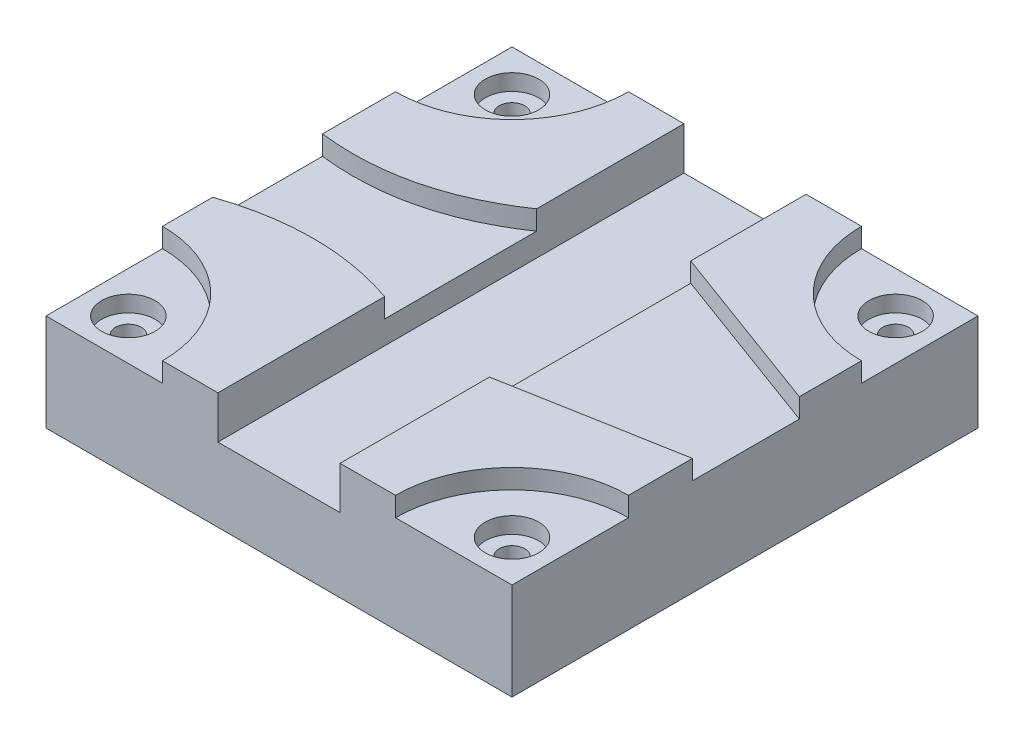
ISO-10303-21;
HEADER;
FILE_DESCRIPTION(('STEP AP214'),'2;1');
FILE_NAME('part.step','',(''),(''),'','','');
FILE_SCHEMA(('AUTOMOTIVE_DESIGN { 1 0 10303 214 1 1 1 1 }'));
ENDSEC;
DATA;
#1=APPLICATION_CONTEXT('core data for automotive mechanical design processes');
#2=APPLICATION_PROTOCOL_DEFINITION('international standard','automotive_design',2000,#1);
#3=PRODUCT_CONTEXT('',#1,'mechanical');
#4=PRODUCT('Part','Part','',(#3));
#5=PRODUCT_RELATED_PRODUCT_CATEGORY('part','',(#4));
#6=PRODUCT_DEFINITION_FORMATION('','',#4);
#7=PRODUCT_DEFINITION_CONTEXT('part definition',#1,'design');
#8=PRODUCT_DEFINITION('design','',#6,#7);
#9=PRODUCT_DEFINITION_SHAPE('','',#8);
#10=(LENGTH_UNIT() NAMED_UNIT(*) SI_UNIT(.MILLI.,.METRE.));
#11=(NAMED_UNIT(*) PLANE_ANGLE_UNIT() SI_UNIT($,.RADIAN.));
#12=(NAMED_UNIT(*) SI_UNIT($,.STERADIAN.) SOLID_ANGLE_UNIT());
#13=UNCERTAINTY_MEASURE_WITH_UNIT(LENGTH_MEASURE(1.E-05),#10,'distance_accuracy_value','');
#14=(GEOMETRIC_REPRESENTATION_CONTEXT(3) GLOBAL_UNCERTAINTY_ASSIGNED_CONTEXT((#13)) GLOBAL_UNIT_ASSIGNED_CONTEXT((#10,
#11,#12)) REPRESENTATION_CONTEXT('',''));
#15=CARTESIAN_POINT('',(0.,0.,0.));
#16=DIRECTION('',(0.,0.,1.));
#17=DIRECTION('',(1.,0.,0.));
#18=AXIS2_PLACEMENT_3D('',#15,#16,#17);
#19=CARTESIAN_POINT('',(-48.1112340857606,0.,16.8721218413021));
#20=DIRECTION('',(0.,1.,0.));
#21=DIRECTION('',(0.,0.,1.));
#22=AXIS2_PLACEMENT_3D('',#19,#20,#21);
#23=PLANE('',#22);
#24=CARTESIAN_POINT('',(76.2,0.,76.2));
#25=DIRECTION('',(0.,1.,0.));
#26=DIRECTION('',(0.,0.,1.));
#27=AXIS2_PLACEMENT_3D('',#24,#25,#26);
#28=CIRCLE('',#27,38.1);
#29=CARTESIAN_POINT('',(76.2,0.,38.1));
#30=VERTEX_POINT('',#29);
#31=CARTESIAN_POINT('',(38.1,0.,76.2));
#32=VERTEX_POINT('',#31);
#33=EDGE_CURVE('E459',#30,#32,#28,.T.);
#34=ORIENTED_EDGE('',*,*,#33,.F.);
#35=DIRECTION('',(0.,0.,1.));
#36=VECTOR('',#35,1.);
#37=CARTESIAN_POINT('',(76.2,0.,76.2));
#38=LINE('',#37,#36);
#39=CARTESIAN_POINT('',(76.2,0.,17.1784901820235));
#40=VERTEX_POINT('',#39);
#41=EDGE_CURVE('E267',#40,#30,#38,.T.);
#42=ORIENTED_EDGE('',*,*,#41,.F.);
#43=DIRECTION('',(0.984064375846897,0.,-0.177812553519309));
#44=VECTOR('',#43,1.);
#45=CARTESIAN_POINT('',(19.9773306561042,0.,27.3374763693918));
#46=LINE('',#45,#44);
#47=CARTESIAN_POINT('',(19.9773306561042,0.,27.3374763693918));
#48=VERTEX_POINT('',#47);
#49=EDGE_CURVE('E228',#40,#48,#46,.F.);
#50=ORIENTED_EDGE('',*,*,#49,.T.);
#51=DIRECTION('',(0.,0.,-1.));
#52=VECTOR('',#51,1.);
#53=CARTESIAN_POINT('',(19.9773306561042,0.,76.2));
#54=LINE('',#53,#52);
#55=CARTESIAN_POINT('',(19.9773306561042,0.,76.2));
#56=VERTEX_POINT('',#55);
#57=EDGE_CURVE('E241',#56,#48,#54,.T.);
#58=ORIENTED_EDGE('',*,*,#57,.F.);
#59=DIRECTION('',(1.,0.,0.));
#60=VECTOR('',#59,1.);
#61=CARTESIAN_POINT('',(-19.9773306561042,0.,76.2));
#62=LINE('',#61,#60);
#63=EDGE_CURVE('E337',#56,#32,#62,.T.);
#64=ORIENTED_EDGE('',*,*,#63,.T.);
#65=EDGE_LOOP('',(#34,#42,#50,#58,#64));
#66=FACE_BOUND('',#65,.T.);
#67=ADVANCED_FACE('F34',(#66),#23,.T.);
#68=CARTESIAN_POINT('',(0.,-6.35,0.));
#69=DIRECTION('',(0.,-1.,0.));
#70=DIRECTION('',(0.,0.,-1.));
#71=AXIS2_PLACEMENT_3D('',#68,#69,#70);
#72=PLANE('',#71);
#73=CARTESIAN_POINT('',(-76.200000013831,-6.35,-14.2260239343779));
#74=CARTESIAN_POINT('',(-45.5451364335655,-6.35,-10.4992931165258));
#75=CARTESIAN_POINT('',(-19.9773306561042,-6.35,-28.0253360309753));
#76=B_SPLINE_CURVE_WITH_KNOTS('',2,(#73,#74,#75),.UNSPECIFIED.,.F.,.F.,(3,3),(0.25164311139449,
0.869678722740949),.UNSPECIFIED.);
#77=CARTESIAN_POINT('',(-76.200000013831,-6.35,-14.2260239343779));
#78=VERTEX_POINT('',#77);
#79=CARTESIAN_POINT('',(-19.9773306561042,-6.35,-28.0253360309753));
#80=VERTEX_POINT('',#79);
#81=EDGE_CURVE('E224',#78,#80,#76,.T.);
#82=ORIENTED_EDGE('',*,*,#81,.F.);
#83=DIRECTION('',(0.,0.,-1.));
#84=VECTOR('',#83,1.);
#85=CARTESIAN_POINT('',(-76.2,-6.35,76.2));
#86=LINE('',#85,#84);
#87=CARTESIAN_POINT('',(-76.2000000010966,-6.35,21.6759097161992));
#88=VERTEX_POINT('',#87);
#89=EDGE_CURVE('E307',#88,#78,#86,.T.);
#90=ORIENTED_EDGE('',*,*,#89,.F.);
#91=CARTESIAN_POINT('',(-19.9773306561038,-6.35,21.6944798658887));
#92=CARTESIAN_POINT('',(-48.1338028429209,-6.35,12.0590488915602));
#93=CARTESIAN_POINT('',(-76.2000000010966,-6.35,21.6759097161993));
#94=B_SPLINE_CURVE_WITH_KNOTS('',2,(#91,#92,#93),.UNSPECIFIED.,.F.,.F.,(3,3),(0.129133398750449,
0.772050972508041),.UNSPECIFIED.);
#95=CARTESIAN_POINT('',(-19.9773306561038,-6.35,21.6944798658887));
#96=VERTEX_POINT('',#95);
#97=EDGE_CURVE('E282',#96,#88,#94,.T.);
#98=ORIENTED_EDGE('',*,*,#97,.F.);
#99=DIRECTION('',(0.,0.,1.));
#100=VECTOR('',#99,1.);
#101=CARTESIAN_POINT('',(-19.9773306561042,-6.35,16.8721218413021));
#102=LINE('',#101,#100);
#103=EDGE_CURVE('E303',#80,#96,#102,.T.);
#104=ORIENTED_EDGE('',*,*,#103,.F.);
#105=EDGE_LOOP('',(#82,#90,#98,#104));
#106=FACE_BOUND('',#105,.T.);
#107=ADVANCED_FACE('F422',(#106),#72,.F.);
#108=CARTESIAN_POINT('',(-19.9773306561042,-6.35,76.2));
#109=DIRECTION('',(0.,0.,1.));
#110=DIRECTION('',(1.,0.,0.));
#111=AXIS2_PLACEMENT_3D('',#108,#109,#110);
#112=PLANE('',#111);
#113=DIRECTION('',(1.,0.,0.));
#114=VECTOR('',#113,1.);
#115=CARTESIAN_POINT('',(-19.9773306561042,-6.34999999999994,76.2));
#116=LINE('',#115,#114);
#117=CARTESIAN_POINT('',(38.1,-6.35000000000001,76.2));
#118=VERTEX_POINT('',#117);
#119=CARTESIAN_POINT('',(76.2,-6.34999999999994,76.2));
#120=VERTEX_POINT('',#119);
#121=EDGE_CURVE('E472',#118,#120,#116,.T.);
#122=ORIENTED_EDGE('',*,*,#121,.F.);
#123=DIRECTION('',(0.,1.,0.));
#124=VECTOR('',#123,1.);
#125=CARTESIAN_POINT('',(38.1,0.,76.2));
#126=LINE('',#125,#124);
#127=EDGE_CURVE('E466',#32,#118,#126,.F.);
#128=ORIENTED_EDGE('',*,*,#127,.F.);
#129=ORIENTED_EDGE('',*,*,#63,.F.);
#130=DIRECTION('',(0.,1.,0.));
#131=VECTOR('',#130,1.);
#132=CARTESIAN_POINT('',(19.9773306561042,-13.97,76.2));
#133=LINE('',#132,#131);
#134=CARTESIAN_POINT('',(19.9773306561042,-13.97,76.2));
#135=VERTEX_POINT('',#134);
#136=EDGE_CURVE('E237',#135,#56,#133,.T.);
#137=ORIENTED_EDGE('',*,*,#136,.F.);
#138=DIRECTION('',(-1.,0.,0.));
#139=VECTOR('',#138,1.);
#140=CARTESIAN_POINT('',(19.9773306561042,-13.97,76.2));
#141=LINE('',#140,#139);
#142=CARTESIAN_POINT('',(-19.9773306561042,-13.97,76.2));
#143=VERTEX_POINT('',#142);
#144=EDGE_CURVE('E450',#135,#143,#141,.T.);
#145=ORIENTED_EDGE('',*,*,#144,.T.);
#146=DIRECTION('',(0.,1.,0.));
#147=VECTOR('',#146,1.);
#148=CARTESIAN_POINT('',(-19.9773306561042,-13.97,76.2));
#149=LINE('',#148,#147);
#150=CARTESIAN_POINT('',(-19.9773306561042,0.,76.2));
#151=VERTEX_POINT('',#150);
#152=EDGE_CURVE('E236',#143,#151,#149,.T.);
#153=ORIENTED_EDGE('',*,*,#152,.T.);
#154=CARTESIAN_POINT('',(-38.1,0.,76.2));
#155=VERTEX_POINT('',#154);
#156=EDGE_CURVE('E328',#155,#151,#62,.T.);
#157=ORIENTED_EDGE('',*,*,#156,.F.);
#158=DIRECTION('',(0.,1.,0.));
#159=VECTOR('',#158,1.);
#160=CARTESIAN_POINT('',(-38.1,0.,76.2));
#161=LINE('',#160,#159);
#162=CARTESIAN_POINT('',(-38.1,-6.35000000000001,76.2));
#163=VERTEX_POINT('',#162);
#164=EDGE_CURVE('E363',#163,#155,#161,.T.);
#165=ORIENTED_EDGE('',*,*,#164,.F.);
#166=DIRECTION('',(1.,0.,0.));
#167=VECTOR('',#166,1.);
#168=CARTESIAN_POINT('',(-19.9773306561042,-6.34999999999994,76.2));
#169=LINE('',#168,#167);
#170=CARTESIAN_POINT('',(-76.2,-6.34999999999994,76.2));
#171=VERTEX_POINT('',#170);
#172=EDGE_CURVE('E366',#171,#163,#169,.T.);
#173=ORIENTED_EDGE('',*,*,#172,.F.);
#174=DIRECTION('',(0.,-1.,0.));
#175=VECTOR('',#174,1.);
#176=CARTESIAN_POINT('',(-76.2,-6.35,76.2));
#177=LINE('',#176,#175);
#178=CARTESIAN_POINT('',(-76.2,-38.1,76.2));
#179=VERTEX_POINT('',#178);
#180=EDGE_CURVE('E306',#171,#179,#177,.T.);
#181=ORIENTED_EDGE('',*,*,#180,.T.);
#182=DIRECTION('',(-1.,0.,0.));
#183=VECTOR('',#182,1.);
#184=CARTESIAN_POINT('',(-19.9773306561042,-38.1,76.2));
#185=LINE('',#184,#183);
#186=CARTESIAN_POINT('',(76.2,-38.1,76.2));
#187=VERTEX_POINT('',#186);
#188=EDGE_CURVE('E317',#187,#179,#185,.T.);
#189=ORIENTED_EDGE('',*,*,#188,.F.);
#190=DIRECTION('',(0.,-1.,0.));
#191=VECTOR('',#190,1.);
#192=CARTESIAN_POINT('',(76.2,-38.1,76.2));
#193=LINE('',#192,#191);
#194=EDGE_CURVE('E266',#120,#187,#193,.T.);
#195=ORIENTED_EDGE('',*,*,#194,.F.);
#196=EDGE_LOOP('',(#122,#128,#129,#137,#145,#153,#157,#165,#173,#181,#189,#195));
#197=FACE_BOUND('',#196,.T.);
#198=ADVANCED_FACE('F424',(#197),#112,.T.);
#199=CARTESIAN_POINT('',(76.2,0.,-76.2));
#200=DIRECTION('',(0.,1.,0.));
#201=DIRECTION('',(0.,0.,1.));
#202=AXIS2_PLACEMENT_3D('',#199,#200,#201);
#203=CIRCLE('',#202,38.1);
#204=CARTESIAN_POINT('',(38.1,0.,-76.2));
#205=VERTEX_POINT('',#204);
#206=CARTESIAN_POINT('',(76.2,0.,-38.1));
#207=VERTEX_POINT('',#206);
#208=EDGE_CURVE('E57',#205,#207,#203,.T.);
#209=ORIENTED_EDGE('',*,*,#208,.F.);
#210=DIRECTION('',(-1.,0.,0.));
#211=VECTOR('',#210,1.);
#212=CARTESIAN_POINT('',(76.2,0.,-76.2));
#213=LINE('',#212,#211);
#214=CARTESIAN_POINT('',(19.9773306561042,0.,-76.2));
#215=VERTEX_POINT('',#214);
#216=EDGE_CURVE('E275',#205,#215,#213,.T.);
#217=ORIENTED_EDGE('',*,*,#216,.T.);
#218=CARTESIAN_POINT('',(19.9773306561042,0.,-38.4697678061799));
#219=VERTEX_POINT('',#218);
#220=EDGE_CURVE('E239',#219,#215,#54,.T.);
#221=ORIENTED_EDGE('',*,*,#220,.F.);
#222=DIRECTION('',(0.93848184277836,0.,0.345328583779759));
#223=VECTOR('',#222,1.);
#224=CARTESIAN_POINT('',(-22.0560936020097,0.,-53.9366018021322));
#225=LINE('',#224,#223);
#226=CARTESIAN_POINT('',(76.2,0.,-17.7817865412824));
#227=VERTEX_POINT('',#226);
#228=EDGE_CURVE('E506',#227,#219,#225,.F.);
#229=ORIENTED_EDGE('',*,*,#228,.F.);
#230=EDGE_CURVE('E264',#207,#227,#38,.T.);
#231=ORIENTED_EDGE('',*,*,#230,.F.);
#232=EDGE_LOOP('',(#209,#217,#221,#229,#231));
#233=FACE_BOUND('',#232,.T.);
#234=ADVANCED_FACE('F414',(#233),#23,.T.);
#235=CARTESIAN_POINT('',(0.,0.,-76.2));
#236=DIRECTION('',(0.,0.,1.));
#237=DIRECTION('',(1.,0.,0.));
#238=AXIS2_PLACEMENT_3D('',#235,#236,#237);
#239=PLANE('',#238);
#240=DIRECTION('',(0.,1.,0.));
#241=VECTOR('',#240,1.);
#242=CARTESIAN_POINT('',(-76.2,-6.35,-76.2));
#243=LINE('',#242,#241);
#244=CARTESIAN_POINT('',(-76.2,-38.1,-76.2));
#245=VERTEX_POINT('',#244);
#246=CARTESIAN_POINT('',(-76.2,-6.34999999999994,-76.2));
#247=VERTEX_POINT('',#246);
#248=EDGE_CURVE('E280',#245,#247,#243,.T.);
#249=ORIENTED_EDGE('',*,*,#248,.T.);
#250=DIRECTION('',(1.,0.,0.));
#251=VECTOR('',#250,1.);
#252=CARTESIAN_POINT('',(0.,-6.34999999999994,-76.2));
#253=LINE('',#252,#251);
#254=CARTESIAN_POINT('',(-38.1,-6.35000000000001,-76.2));
#255=VERTEX_POINT('',#254);
#256=EDGE_CURVE('E42',#247,#255,#253,.T.);
#257=ORIENTED_EDGE('',*,*,#256,.T.);
#258=DIRECTION('',(0.,1.,0.));
#259=VECTOR('',#258,1.);
#260=CARTESIAN_POINT('',(-38.1,0.,-76.2));
#261=LINE('',#260,#259);
#262=CARTESIAN_POINT('',(-38.1,0.,-76.2));
#263=VERTEX_POINT('',#262);
#264=EDGE_CURVE('E195',#255,#263,#261,.T.);
#265=ORIENTED_EDGE('',*,*,#264,.T.);
#266=DIRECTION('',(-1.,0.,0.));
#267=VECTOR('',#266,1.);
#268=CARTESIAN_POINT('',(-76.200000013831,0.,-76.2));
#269=LINE('',#268,#267);
#270=CARTESIAN_POINT('',(-19.9773306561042,0.,-76.2));
#271=VERTEX_POINT('',#270);
#272=EDGE_CURVE('E209',#271,#263,#269,.T.);
#273=ORIENTED_EDGE('',*,*,#272,.F.);
#274=DIRECTION('',(0.,-1.,0.));
#275=VECTOR('',#274,1.);
#276=CARTESIAN_POINT('',(-19.9773306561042,0.,-76.2));
#277=LINE('',#276,#275);
#278=CARTESIAN_POINT('',(-19.9773306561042,-13.97,-76.2));
#279=VERTEX_POINT('',#278);
#280=EDGE_CURVE('E261',#271,#279,#277,.T.);
#281=ORIENTED_EDGE('',*,*,#280,.T.);
#282=DIRECTION('',(-1.,0.,0.));
#283=VECTOR('',#282,1.);
#284=CARTESIAN_POINT('',(19.9773306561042,-13.97,-76.2));
#285=LINE('',#284,#283);
#286=CARTESIAN_POINT('',(19.9773306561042,-13.97,-76.2));
#287=VERTEX_POINT('',#286);
#288=EDGE_CURVE('E249',#287,#279,#285,.T.);
#289=ORIENTED_EDGE('',*,*,#288,.F.);
#290=DIRECTION('',(0.,-1.,0.));
#291=VECTOR('',#290,1.);
#292=CARTESIAN_POINT('',(19.9773306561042,0.,-76.2));
#293=LINE('',#292,#291);
#294=EDGE_CURVE('E244',#215,#287,#293,.T.);
#295=ORIENTED_EDGE('',*,*,#294,.F.);
#296=ORIENTED_EDGE('',*,*,#216,.F.);
#297=DIRECTION('',(0.,1.,0.));
#298=VECTOR('',#297,1.);
#299=CARTESIAN_POINT('',(38.1,0.,-76.2));
#300=LINE('',#299,#298);
#301=CARTESIAN_POINT('',(38.1,-6.35000000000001,-76.2));
#302=VERTEX_POINT('',#301);
#303=EDGE_CURVE('E441',#205,#302,#300,.F.);
#304=ORIENTED_EDGE('',*,*,#303,.T.);
#305=DIRECTION('',(1.,0.,0.));
#306=VECTOR('',#305,1.);
#307=CARTESIAN_POINT('',(0.,-6.34999999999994,-76.2));
#308=LINE('',#307,#306);
#309=CARTESIAN_POINT('',(76.2,-6.34999999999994,-76.2));
#310=VERTEX_POINT('',#309);
#311=EDGE_CURVE('E463',#302,#310,#308,.T.);
#312=ORIENTED_EDGE('',*,*,#311,.T.);
#313=DIRECTION('',(0.,1.,0.));
#314=VECTOR('',#313,1.);
#315=CARTESIAN_POINT('',(76.2,0.,-76.2));
#316=LINE('',#315,#314);
#317=CARTESIAN_POINT('',(76.2,-38.1,-76.2));
#318=VERTEX_POINT('',#317);
#319=EDGE_CURVE('E272',#318,#310,#316,.T.);
#320=ORIENTED_EDGE('',*,*,#319,.F.);
#321=DIRECTION('',(-1.,0.,0.));
#322=VECTOR('',#321,1.);
#323=CARTESIAN_POINT('',(-76.2,-38.1,-76.2));
#324=LINE('',#323,#322);
#325=EDGE_CURVE('E277',#318,#245,#324,.T.);
#326=ORIENTED_EDGE('',*,*,#325,.T.);
#327=EDGE_LOOP('',(#249,#257,#265,#273,#281,#289,#295,#296,#304,#312,#320,#326));
#328=FACE_BOUND('',#327,.T.);
#329=ADVANCED_FACE('F207',(#328),#239,.F.);
#330=CARTESIAN_POINT('',(-76.2,-6.35,76.2));
#331=DIRECTION('',(-1.,0.,0.));
#332=DIRECTION('',(0.,0.,1.));
#333=AXIS2_PLACEMENT_3D('',#330,#331,#332);
#334=PLANE('',#333);
#335=DIRECTION('',(0.,0.,1.));
#336=VECTOR('',#335,1.);
#337=CARTESIAN_POINT('',(-76.2,-6.34999999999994,76.2));
#338=LINE('',#337,#336);
#339=CARTESIAN_POINT('',(-76.2,-6.35000000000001,-38.1));
#340=VERTEX_POINT('',#339);
#341=EDGE_CURVE('E11',#247,#340,#338,.T.);
#342=ORIENTED_EDGE('',*,*,#341,.F.);
#343=ORIENTED_EDGE('',*,*,#248,.F.);
#344=DIRECTION('',(0.,0.,-1.));
#345=VECTOR('',#344,1.);
#346=CARTESIAN_POINT('',(-76.2,-38.1,76.2));
#347=LINE('',#346,#345);
#348=EDGE_CURVE('E315',#179,#245,#347,.T.);
#349=ORIENTED_EDGE('',*,*,#348,.F.);
#350=ORIENTED_EDGE('',*,*,#180,.F.);
#351=DIRECTION('',(0.,0.,1.));
#352=VECTOR('',#351,1.);
#353=CARTESIAN_POINT('',(-76.2,-6.34999999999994,76.2));
#354=LINE('',#353,#352);
#355=CARTESIAN_POINT('',(-76.2,-6.35000000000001,38.1));
#356=VERTEX_POINT('',#355);
#357=EDGE_CURVE('E322',#356,#171,#354,.T.);
#358=ORIENTED_EDGE('',*,*,#357,.F.);
#359=DIRECTION('',(0.,1.,0.));
#360=VECTOR('',#359,1.);
#361=CARTESIAN_POINT('',(-76.2,0.,38.1));
#362=LINE('',#361,#360);
#363=CARTESIAN_POINT('',(-76.2000000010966,0.,38.1));
#364=VERTEX_POINT('',#363);
#365=EDGE_CURVE('E358',#364,#356,#362,.F.);
#366=ORIENTED_EDGE('',*,*,#365,.F.);
#367=DIRECTION('',(0.,0.,1.));
#368=VECTOR('',#367,1.);
#369=CARTESIAN_POINT('',(-76.2000000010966,0.,76.2));
#370=LINE('',#369,#368);
#371=CARTESIAN_POINT('',(-76.2000000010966,0.,21.6759097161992));
#372=VERTEX_POINT('',#371);
#373=EDGE_CURVE('E287',#372,#364,#370,.T.);
#374=ORIENTED_EDGE('',*,*,#373,.F.);
#375=DIRECTION('',(0.,-1.,0.));
#376=VECTOR('',#375,1.);
#377=CARTESIAN_POINT('',(-76.2000000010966,0.,21.6759097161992));
#378=LINE('',#377,#376);
#379=EDGE_CURVE('E325',#372,#88,#378,.T.);
#380=ORIENTED_EDGE('',*,*,#379,.T.);
#381=ORIENTED_EDGE('',*,*,#89,.T.);
#382=DIRECTION('',(0.,-1.,0.));
#383=VECTOR('',#382,1.);
#384=CARTESIAN_POINT('',(-76.200000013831,0.,-14.2260239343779));
#385=LINE('',#384,#383);
#386=CARTESIAN_POINT('',(-76.200000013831,0.,-14.2260239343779));
#387=VERTEX_POINT('',#386);
#388=EDGE_CURVE('E218',#387,#78,#385,.T.);
#389=ORIENTED_EDGE('',*,*,#388,.F.);
#390=DIRECTION('',(0.,0.,1.));
#391=VECTOR('',#390,1.);
#392=CARTESIAN_POINT('',(-76.200000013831,0.,-14.2260239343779));
#393=LINE('',#392,#391);
#394=CARTESIAN_POINT('',(-76.200000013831,0.,-38.1));
#395=VERTEX_POINT('',#394);
#396=EDGE_CURVE('E216',#395,#387,#393,.T.);
#397=ORIENTED_EDGE('',*,*,#396,.F.);
#398=DIRECTION('',(0.,1.,0.));
#399=VECTOR('',#398,1.);
#400=CARTESIAN_POINT('',(-76.2,0.,-38.1));
#401=LINE('',#400,#399);
#402=EDGE_CURVE('E49',#340,#395,#401,.T.);
#403=ORIENTED_EDGE('',*,*,#402,.F.);
#404=EDGE_LOOP('',(#342,#343,#349,#350,#358,#366,#374,#380,#381,#389,#397,#403));
#405=FACE_BOUND('',#404,.T.);
#406=ADVANCED_FACE('F356',(#405),#334,.T.);
#407=CARTESIAN_POINT('',(0.,-38.1,0.));
#408=DIRECTION('',(0.,-1.,0.));
#409=DIRECTION('',(0.,0.,-1.));
#410=AXIS2_PLACEMENT_3D('',#407,#408,#409);
#411=PLANE('',#410);
#412=CARTESIAN_POINT('',(-62.7296158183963,-38.1,-62.7296158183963));
#413=DIRECTION('',(0.,1.,0.));
#414=DIRECTION('',(0.,0.,1.));
#415=AXIS2_PLACEMENT_3D('',#412,#413,#414);
#416=CIRCLE('',#415,4.2164);
#417=CARTESIAN_POINT('',(-62.7296158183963,-38.1,-58.5132158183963));
#418=VERTEX_POINT('',#417);
#419=EDGE_CURVE('E833',#418,#418,#416,.T.);
#420=ORIENTED_EDGE('',*,*,#419,.T.);
#421=EDGE_LOOP('',(#420));
#422=FACE_BOUND('',#421,.T.);
#423=CARTESIAN_POINT('',(62.7296158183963,-38.1,-62.7296158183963));
#424=DIRECTION('',(0.,1.,0.));
#425=DIRECTION('',(0.,0.,1.));
#426=AXIS2_PLACEMENT_3D('',#423,#424,#425);
#427=CIRCLE('',#426,4.21640000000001);
#428=CARTESIAN_POINT('',(62.7296158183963,-38.1,-58.5132158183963));
#429=VERTEX_POINT('',#428);
#430=EDGE_CURVE('E844',#429,#429,#427,.T.);
#431=ORIENTED_EDGE('',*,*,#430,.T.);
#432=EDGE_LOOP('',(#431));
#433=FACE_BOUND('',#432,.T.);
#434=CARTESIAN_POINT('',(62.7296158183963,-38.1,62.7296158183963));
#435=DIRECTION('',(0.,1.,0.));
#436=DIRECTION('',(0.,0.,1.));
#437=AXIS2_PLACEMENT_3D('',#434,#435,#436);
#438=CIRCLE('',#437,4.21640000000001);
#439=CARTESIAN_POINT('',(62.7296158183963,-38.1,66.9460158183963));
#440=VERTEX_POINT('',#439);
#441=EDGE_CURVE('E856',#440,#440,#438,.T.);
#442=ORIENTED_EDGE('',*,*,#441,.T.);
#443=EDGE_LOOP('',(#442));
#444=FACE_BOUND('',#443,.T.);
#445=CARTESIAN_POINT('',(-62.7296158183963,-38.1,62.7296158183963));
#446=DIRECTION('',(0.,1.,0.));
#447=DIRECTION('',(0.,0.,1.));
#448=AXIS2_PLACEMENT_3D('',#445,#446,#447);
#449=CIRCLE('',#448,4.2164);
#450=CARTESIAN_POINT('',(-62.7296158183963,-38.1,66.9460158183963));
#451=VERTEX_POINT('',#450);
#452=EDGE_CURVE('E201',#451,#451,#449,.T.);
#453=ORIENTED_EDGE('',*,*,#452,.T.);
#454=EDGE_LOOP('',(#453));
#455=FACE_BOUND('',#454,.T.);
#456=ORIENTED_EDGE('',*,*,#348,.T.);
#457=ORIENTED_EDGE('',*,*,#325,.F.);
#458=DIRECTION('',(0.,0.,-1.));
#459=VECTOR('',#458,1.);
#460=CARTESIAN_POINT('',(76.2,-38.1,-76.2));
#461=LINE('',#460,#459);
#462=EDGE_CURVE('E269',#187,#318,#461,.T.);
#463=ORIENTED_EDGE('',*,*,#462,.F.);
#464=ORIENTED_EDGE('',*,*,#188,.T.);
#465=EDGE_LOOP('',(#456,#457,#463,#464));
#466=FACE_BOUND('',#465,.T.);
#467=ADVANCED_FACE('F419',(#422,#433,#444,#455,#466),#411,.T.);
#468=CARTESIAN_POINT('',(-19.9773306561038,0.,21.6944798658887));
#469=CARTESIAN_POINT('',(-48.1338028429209,0.,12.0590488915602));
#470=CARTESIAN_POINT('',(-76.2000000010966,0.,21.6759097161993));
#471=B_SPLINE_CURVE_WITH_KNOTS('',2,(#468,#469,#470),.UNSPECIFIED.,.F.,.F.,(3,3),
(0.129133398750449,0.772050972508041),.UNSPECIFIED.);
#472=DIRECTION('',(0.,-1.,0.));
#473=VECTOR('',#472,1.);
#474=SURFACE_OF_LINEAR_EXTRUSION('',#471,#473);
#475=ORIENTED_EDGE('',*,*,#97,.T.);
#476=ORIENTED_EDGE('',*,*,#379,.F.);
#477=CARTESIAN_POINT('',(-19.9773306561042,0.,21.6944798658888));
#478=VERTEX_POINT('',#477);
#479=EDGE_CURVE('E298',#478,#372,#471,.T.);
#480=ORIENTED_EDGE('',*,*,#479,.F.);
#481=DIRECTION('',(0.,-1.,0.));
#482=VECTOR('',#481,1.);
#483=CARTESIAN_POINT('',(-19.9773306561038,0.,21.6944798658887));
#484=LINE('',#483,#482);
#485=EDGE_CURVE('E318',#478,#96,#484,.T.);
#486=ORIENTED_EDGE('',*,*,#485,.T.);
#487=EDGE_LOOP('',(#475,#476,#480,#486));
#488=FACE_BOUND('',#487,.T.);
#489=ADVANCED_FACE('F294',(#488),#474,.F.);
#490=CARTESIAN_POINT('',(-76.2,0.,76.2));
#491=DIRECTION('',(0.,1.,0.));
#492=DIRECTION('',(0.,0.,1.));
#493=AXIS2_PLACEMENT_3D('',#490,#491,#492);
#494=CIRCLE('',#493,38.1);
#495=EDGE_CURVE('E350',#155,#364,#494,.T.);
#496=ORIENTED_EDGE('',*,*,#495,.F.);
#497=ORIENTED_EDGE('',*,*,#156,.T.);
#498=DIRECTION('',(0.,0.,-1.));
#499=VECTOR('',#498,1.);
#500=CARTESIAN_POINT('',(-19.9773306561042,0.,76.2));
#501=LINE('',#500,#499);
#502=EDGE_CURVE('E252',#151,#478,#501,.T.);
#503=ORIENTED_EDGE('',*,*,#502,.T.);
#504=ORIENTED_EDGE('',*,*,#479,.T.);
#505=ORIENTED_EDGE('',*,*,#373,.T.);
#506=EDGE_LOOP('',(#496,#497,#503,#504,#505));
#507=FACE_BOUND('',#506,.T.);
#508=ADVANCED_FACE('F349',(#507),#23,.T.);
#509=CARTESIAN_POINT('',(76.2,0.,0.));
#510=DIRECTION('',(-1.,0.,0.));
#511=DIRECTION('',(0.,0.,1.));
#512=AXIS2_PLACEMENT_3D('',#509,#510,#511);
#513=PLANE('',#512);
#514=ORIENTED_EDGE('',*,*,#319,.T.);
#515=DIRECTION('',(0.,0.,1.));
#516=VECTOR('',#515,1.);
#517=CARTESIAN_POINT('',(76.2,-6.34999999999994,0.));
#518=LINE('',#517,#516);
#519=CARTESIAN_POINT('',(76.2,-6.35000000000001,-38.1));
#520=VERTEX_POINT('',#519);
#521=EDGE_CURVE('E210',#310,#520,#518,.T.);
#522=ORIENTED_EDGE('',*,*,#521,.T.);
#523=DIRECTION('',(0.,1.,0.));
#524=VECTOR('',#523,1.);
#525=CARTESIAN_POINT('',(76.2,0.,-38.1));
#526=LINE('',#525,#524);
#527=EDGE_CURVE('E495',#520,#207,#526,.T.);
#528=ORIENTED_EDGE('',*,*,#527,.T.);
#529=ORIENTED_EDGE('',*,*,#230,.T.);
#530=DIRECTION('',(0.,1.,0.));
#531=VECTOR('',#530,1.);
#532=CARTESIAN_POINT('',(76.2,0.,-17.7817865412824));
#533=LINE('',#532,#531);
#534=CARTESIAN_POINT('',(76.2,-6.35,-17.7817865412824));
#535=VERTEX_POINT('',#534);
#536=EDGE_CURVE('E377',#227,#535,#533,.F.);
#537=ORIENTED_EDGE('',*,*,#536,.T.);
#538=DIRECTION('',(0.,0.,1.));
#539=VECTOR('',#538,1.);
#540=CARTESIAN_POINT('',(76.2,-6.35,-38.46976780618));
#541=LINE('',#540,#539);
#542=CARTESIAN_POINT('',(76.2,-6.35,17.1784901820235));
#543=VERTEX_POINT('',#542);
#544=EDGE_CURVE('E373',#535,#543,#541,.T.);
#545=ORIENTED_EDGE('',*,*,#544,.T.);
#546=DIRECTION('',(0.,-1.,0.));
#547=VECTOR('',#546,1.);
#548=CARTESIAN_POINT('',(76.2,0.,17.1784901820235));
#549=LINE('',#548,#547);
#550=EDGE_CURVE('E376',#543,#40,#549,.F.);
#551=ORIENTED_EDGE('',*,*,#550,.T.);
#552=ORIENTED_EDGE('',*,*,#41,.T.);
#553=DIRECTION('',(0.,1.,0.));
#554=VECTOR('',#553,1.);
#555=CARTESIAN_POINT('',(76.2,0.,38.1));
#556=LINE('',#555,#554);
#557=CARTESIAN_POINT('',(76.2,-6.35000000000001,38.1));
#558=VERTEX_POINT('',#557);
#559=EDGE_CURVE('E456',#30,#558,#556,.F.);
#560=ORIENTED_EDGE('',*,*,#559,.T.);
#561=DIRECTION('',(0.,0.,1.));
#562=VECTOR('',#561,1.);
#563=CARTESIAN_POINT('',(76.2,-6.34999999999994,0.));
#564=LINE('',#563,#562);
#565=EDGE_CURVE('E498',#558,#120,#564,.T.);
#566=ORIENTED_EDGE('',*,*,#565,.T.);
#567=ORIENTED_EDGE('',*,*,#194,.T.);
#568=ORIENTED_EDGE('',*,*,#462,.T.);
#569=EDGE_LOOP('',(#514,#522,#528,#529,#537,#545,#551,#552,#560,#566,#567,#568));
#570=FACE_BOUND('',#569,.T.);
#571=ADVANCED_FACE('F405',(#570),#513,.F.);
#572=CARTESIAN_POINT('',(-19.9773306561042,0.,0.));
#573=DIRECTION('',(-1.,0.,0.));
#574=DIRECTION('',(0.,0.,1.));
#575=AXIS2_PLACEMENT_3D('',#572,#573,#574);
#576=PLANE('',#575);
#577=ORIENTED_EDGE('',*,*,#485,.F.);
#578=ORIENTED_EDGE('',*,*,#502,.F.);
#579=ORIENTED_EDGE('',*,*,#152,.F.);
#580=DIRECTION('',(0.,0.,1.));
#581=VECTOR('',#580,1.);
#582=CARTESIAN_POINT('',(-19.9773306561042,-13.97,-76.2));
#583=LINE('',#582,#581);
#584=EDGE_CURVE('E240',#279,#143,#583,.T.);
#585=ORIENTED_EDGE('',*,*,#584,.F.);
#586=ORIENTED_EDGE('',*,*,#280,.F.);
#587=DIRECTION('',(0.,0.,-1.));
#588=VECTOR('',#587,1.);
#589=CARTESIAN_POINT('',(-19.9773306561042,0.,-76.2));
#590=LINE('',#589,#588);
#591=CARTESIAN_POINT('',(-19.9773306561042,0.,-28.0253360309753));
#592=VERTEX_POINT('',#591);
#593=EDGE_CURVE('E215',#592,#271,#590,.T.);
#594=ORIENTED_EDGE('',*,*,#593,.F.);
#595=DIRECTION('',(0.,-1.,0.));
#596=VECTOR('',#595,1.);
#597=CARTESIAN_POINT('',(-19.9773306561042,0.,-28.0253360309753));
#598=LINE('',#597,#596);
#599=EDGE_CURVE('E233',#592,#80,#598,.T.);
#600=ORIENTED_EDGE('',*,*,#599,.T.);
#601=ORIENTED_EDGE('',*,*,#103,.T.);
#602=EDGE_LOOP('',(#577,#578,#579,#585,#586,#594,#600,#601));
#603=FACE_BOUND('',#602,.T.);
#604=ADVANCED_FACE('F402',(#603),#576,.F.);
#605=CARTESIAN_POINT('',(19.9773306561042,-13.97,-76.2));
#606=DIRECTION('',(0.,-1.,0.));
#607=DIRECTION('',(0.,0.,-1.));
#608=AXIS2_PLACEMENT_3D('',#605,#606,#607);
#609=PLANE('',#608);
#610=ORIENTED_EDGE('',*,*,#584,.T.);
#611=ORIENTED_EDGE('',*,*,#144,.F.);
#612=DIRECTION('',(0.,0.,1.));
#613=VECTOR('',#612,1.);
#614=CARTESIAN_POINT('',(19.9773306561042,-13.97,-76.2));
#615=LINE('',#614,#613);
#616=EDGE_CURVE('E246',#287,#135,#615,.T.);
#617=ORIENTED_EDGE('',*,*,#616,.F.);
#618=ORIENTED_EDGE('',*,*,#288,.T.);
#619=EDGE_LOOP('',(#610,#611,#617,#618));
#620=FACE_BOUND('',#619,.T.);
#621=ADVANCED_FACE('F400',(#620),#609,.F.);
#622=CARTESIAN_POINT('',(19.9773306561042,0.,0.));
#623=DIRECTION('',(-1.,0.,0.));
#624=DIRECTION('',(0.,0.,1.));
#625=AXIS2_PLACEMENT_3D('',#622,#623,#624);
#626=PLANE('',#625);
#627=DIRECTION('',(0.,1.,0.));
#628=VECTOR('',#627,1.);
#629=CARTESIAN_POINT('',(19.9773306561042,-6.35,27.3374763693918));
#630=LINE('',#629,#628);
#631=CARTESIAN_POINT('',(19.9773306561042,-6.35,27.3374763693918));
#632=VERTEX_POINT('',#631);
#633=EDGE_CURVE('E383',#632,#48,#630,.T.);
#634=ORIENTED_EDGE('',*,*,#633,.F.);
#635=DIRECTION('',(0.,0.,1.));
#636=VECTOR('',#635,1.);
#637=CARTESIAN_POINT('',(19.9773306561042,-6.35,-38.46976780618));
#638=LINE('',#637,#636);
#639=CARTESIAN_POINT('',(19.9773306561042,-6.35,-38.46976780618));
#640=VERTEX_POINT('',#639);
#641=EDGE_CURVE('E380',#640,#632,#638,.T.);
#642=ORIENTED_EDGE('',*,*,#641,.F.);
#643=DIRECTION('',(0.,-1.,0.));
#644=VECTOR('',#643,1.);
#645=CARTESIAN_POINT('',(19.9773306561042,0.,-38.46976780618));
#646=LINE('',#645,#644);
#647=EDGE_CURVE('E372',#219,#640,#646,.T.);
#648=ORIENTED_EDGE('',*,*,#647,.F.);
#649=ORIENTED_EDGE('',*,*,#220,.T.);
#650=ORIENTED_EDGE('',*,*,#294,.T.);
#651=ORIENTED_EDGE('',*,*,#616,.T.);
#652=ORIENTED_EDGE('',*,*,#136,.T.);
#653=ORIENTED_EDGE('',*,*,#57,.T.);
#654=EDGE_LOOP('',(#634,#642,#648,#649,#650,#651,#652,#653));
#655=FACE_BOUND('',#654,.T.);
#656=ADVANCED_FACE('F395',(#655),#626,.T.);
#657=CARTESIAN_POINT('',(-76.200000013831,0.,-14.2260239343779));
#658=CARTESIAN_POINT('',(-45.5451364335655,0.,-10.4992931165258));
#659=CARTESIAN_POINT('',(-19.9773306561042,0.,-28.0253360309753));
#660=B_SPLINE_CURVE_WITH_KNOTS('',2,(#657,#658,#659),.UNSPECIFIED.,.F.,.F.,(3,3),
(0.25164311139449,0.869678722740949),.UNSPECIFIED.);
#661=DIRECTION('',(0.,-1.,0.));
#662=VECTOR('',#661,1.);
#663=SURFACE_OF_LINEAR_EXTRUSION('',#660,#662);
#664=ORIENTED_EDGE('',*,*,#81,.T.);
#665=ORIENTED_EDGE('',*,*,#599,.F.);
#666=EDGE_CURVE('E220',#387,#592,#660,.T.);
#667=ORIENTED_EDGE('',*,*,#666,.F.);
#668=ORIENTED_EDGE('',*,*,#388,.T.);
#669=EDGE_LOOP('',(#664,#665,#667,#668));
#670=FACE_BOUND('',#669,.T.);
#671=ADVANCED_FACE('F391',(#670),#663,.F.);
#672=CARTESIAN_POINT('',(-46.8169008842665,0.,-15.8124865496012));
#673=DIRECTION('',(0.,1.,0.));
#674=DIRECTION('',(0.,0.,1.));
#675=AXIS2_PLACEMENT_3D('',#672,#673,#674);
#676=PLANE('',#675);
#677=CARTESIAN_POINT('',(-76.2,0.,-76.2));
#678=DIRECTION('',(0.,1.,0.));
#679=DIRECTION('',(0.,0.,1.));
#680=AXIS2_PLACEMENT_3D('',#677,#678,#679);
#681=CIRCLE('',#680,38.1);
#682=EDGE_CURVE('E192',#395,#263,#681,.T.);
#683=ORIENTED_EDGE('',*,*,#682,.F.);
#684=ORIENTED_EDGE('',*,*,#396,.T.);
#685=ORIENTED_EDGE('',*,*,#666,.T.);
#686=ORIENTED_EDGE('',*,*,#593,.T.);
#687=ORIENTED_EDGE('',*,*,#272,.T.);
#688=EDGE_LOOP('',(#683,#684,#685,#686,#687));
#689=FACE_BOUND('',#688,.T.);
#690=ADVANCED_FACE('F213',(#689),#676,.T.);
#691=CARTESIAN_POINT('',(19.9773306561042,-6.35,27.3374763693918));
#692=DIRECTION('',(-0.177812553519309,0.,-0.984064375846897));
#693=DIRECTION('',(-0.984064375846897,0.,0.177812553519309));
#694=AXIS2_PLACEMENT_3D('',#691,#692,#693);
#695=PLANE('',#694);
#696=ORIENTED_EDGE('',*,*,#633,.T.);
#697=ORIENTED_EDGE('',*,*,#49,.F.);
#698=ORIENTED_EDGE('',*,*,#550,.F.);
#699=DIRECTION('',(0.984064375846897,0.,-0.177812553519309));
#700=VECTOR('',#699,1.);
#701=CARTESIAN_POINT('',(85.9372765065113,-6.35,15.4190422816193));
#702=LINE('',#701,#700);
#703=EDGE_CURVE('E308',#543,#632,#702,.F.);
#704=ORIENTED_EDGE('',*,*,#703,.T.);
#705=EDGE_LOOP('',(#696,#697,#698,#704));
#706=FACE_BOUND('',#705,.T.);
#707=ADVANCED_FACE('F511',(#706),#695,.T.);
#708=CARTESIAN_POINT('',(76.2,-6.35,-38.46976780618));
#709=DIRECTION('',(0.,-1.,0.));
#710=DIRECTION('',(0.,0.,-1.));
#711=AXIS2_PLACEMENT_3D('',#708,#709,#710);
#712=PLANE('',#711);
#713=ORIENTED_EDGE('',*,*,#641,.T.);
#714=ORIENTED_EDGE('',*,*,#703,.F.);
#715=ORIENTED_EDGE('',*,*,#544,.F.);
#716=DIRECTION('',(0.93848184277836,0.,0.345328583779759));
#717=VECTOR('',#716,1.);
#718=CARTESIAN_POINT('',(19.9773306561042,-6.35,-38.46976780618));
#719=LINE('',#718,#717);
#720=EDGE_CURVE('E504',#535,#640,#719,.F.);
#721=ORIENTED_EDGE('',*,*,#720,.T.);
#722=EDGE_LOOP('',(#713,#714,#715,#721));
#723=FACE_BOUND('',#722,.T.);
#724=ADVANCED_FACE('F515',(#723),#712,.F.);
#725=CARTESIAN_POINT('',(19.9773306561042,0.,-38.46976780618));
#726=DIRECTION('',(-0.345328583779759,0.,0.93848184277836));
#727=DIRECTION('',(0.93848184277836,0.,0.345328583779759));
#728=AXIS2_PLACEMENT_3D('',#725,#726,#727);
#729=PLANE('',#728);
#730=ORIENTED_EDGE('',*,*,#647,.T.);
#731=ORIENTED_EDGE('',*,*,#720,.F.);
#732=ORIENTED_EDGE('',*,*,#536,.F.);
#733=ORIENTED_EDGE('',*,*,#228,.T.);
#734=EDGE_LOOP('',(#730,#731,#732,#733));
#735=FACE_BOUND('',#734,.T.);
#736=ADVANCED_FACE('F36',(#735),#729,.T.);
#737=CARTESIAN_POINT('',(-76.2,-6.34999999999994,76.2));
#738=DIRECTION('',(0.,-1.,0.));
#739=DIRECTION('',(0.,0.,-1.));
#740=AXIS2_PLACEMENT_3D('',#737,#738,#739);
#741=PLANE('',#740);
#742=CARTESIAN_POINT('',(-62.7296158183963,-6.34999999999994,62.7296158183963));
#743=DIRECTION('',(0.,1.,0.));
#744=DIRECTION('',(0.,0.,1.));
#745=AXIS2_PLACEMENT_3D('',#742,#743,#744);
#746=CIRCLE('',#745,8.73125);
#747=CARTESIAN_POINT('',(-62.7296158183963,-6.34999999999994,71.4608658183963));
#748=VERTEX_POINT('',#747);
#749=EDGE_CURVE('E859',#748,#748,#746,.T.);
#750=ORIENTED_EDGE('',*,*,#749,.F.);
#751=EDGE_LOOP('',(#750));
#752=FACE_BOUND('',#751,.T.);
#753=ORIENTED_EDGE('',*,*,#172,.T.);
#754=CARTESIAN_POINT('',(-76.2,-6.35000000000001,76.2));
#755=DIRECTION('',(0.,1.,0.));
#756=DIRECTION('',(0.,0.,1.));
#757=AXIS2_PLACEMENT_3D('',#754,#755,#756);
#758=CIRCLE('',#757,38.1);
#759=EDGE_CURVE('E364',#163,#356,#758,.T.);
#760=ORIENTED_EDGE('',*,*,#759,.T.);
#761=ORIENTED_EDGE('',*,*,#357,.T.);
#762=EDGE_LOOP('',(#753,#760,#761));
#763=FACE_BOUND('',#762,.T.);
#764=ADVANCED_FACE('F618',(#752,#763),#741,.F.);
#765=CARTESIAN_POINT('',(-76.2,0.,76.2));
#766=DIRECTION('',(0.,1.,0.));
#767=DIRECTION('',(0.,0.,1.));
#768=AXIS2_PLACEMENT_3D('',#765,#766,#767);
#769=CYLINDRICAL_SURFACE('',#768,38.1);
#770=ORIENTED_EDGE('',*,*,#164,.T.);
#771=ORIENTED_EDGE('',*,*,#495,.T.);
#772=ORIENTED_EDGE('',*,*,#365,.T.);
#773=ORIENTED_EDGE('',*,*,#759,.F.);
#774=EDGE_LOOP('',(#770,#771,#772,#773));
#775=FACE_BOUND('',#774,.T.);
#776=ADVANCED_FACE('F473',(#775),#769,.F.);
#777=CARTESIAN_POINT('',(76.2,-6.34999999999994,76.2));
#778=DIRECTION('',(0.,-1.,0.));
#779=DIRECTION('',(0.,0.,-1.));
#780=AXIS2_PLACEMENT_3D('',#777,#778,#779);
#781=PLANE('',#780);
#782=CARTESIAN_POINT('',(62.7296158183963,-6.34999999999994,62.7296158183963));
#783=DIRECTION('',(0.,1.,0.));
#784=DIRECTION('',(0.,0.,1.));
#785=AXIS2_PLACEMENT_3D('',#782,#783,#784);
#786=CIRCLE('',#785,8.73125);
#787=CARTESIAN_POINT('',(62.7296158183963,-6.34999999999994,71.4608658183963));
#788=VERTEX_POINT('',#787);
#789=EDGE_CURVE('E847',#788,#788,#786,.T.);
#790=ORIENTED_EDGE('',*,*,#789,.F.);
#791=EDGE_LOOP('',(#790));
#792=FACE_BOUND('',#791,.T.);
#793=ORIENTED_EDGE('',*,*,#121,.T.);
#794=ORIENTED_EDGE('',*,*,#565,.F.);
#795=CARTESIAN_POINT('',(76.2,-6.35000000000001,76.2));
#796=DIRECTION('',(0.,1.,0.));
#797=DIRECTION('',(0.,0.,1.));
#798=AXIS2_PLACEMENT_3D('',#795,#796,#797);
#799=CIRCLE('',#798,38.1);
#800=EDGE_CURVE('E462',#558,#118,#799,.T.);
#801=ORIENTED_EDGE('',*,*,#800,.T.);
#802=EDGE_LOOP('',(#793,#794,#801));
#803=FACE_BOUND('',#802,.T.);
#804=ADVANCED_FACE('F520',(#792,#803),#781,.F.);
#805=CARTESIAN_POINT('',(76.2,0.,76.2));
#806=DIRECTION('',(0.,1.,0.));
#807=DIRECTION('',(0.,0.,1.));
#808=AXIS2_PLACEMENT_3D('',#805,#806,#807);
#809=CYLINDRICAL_SURFACE('',#808,38.1);
#810=ORIENTED_EDGE('',*,*,#127,.T.);
#811=ORIENTED_EDGE('',*,*,#800,.F.);
#812=ORIENTED_EDGE('',*,*,#559,.F.);
#813=ORIENTED_EDGE('',*,*,#33,.T.);
#814=EDGE_LOOP('',(#810,#811,#812,#813));
#815=FACE_BOUND('',#814,.T.);
#816=ADVANCED_FACE('F517',(#815),#809,.F.);
#817=CARTESIAN_POINT('',(76.2,-6.34999999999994,-76.2));
#818=DIRECTION('',(0.,-1.,0.));
#819=DIRECTION('',(0.,0.,-1.));
#820=AXIS2_PLACEMENT_3D('',#817,#818,#819);
#821=PLANE('',#820);
#822=CARTESIAN_POINT('',(62.7296158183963,-6.34999999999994,-62.7296158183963));
#823=DIRECTION('',(0.,1.,0.));
#824=DIRECTION('',(0.,0.,1.));
#825=AXIS2_PLACEMENT_3D('',#822,#823,#824);
#826=CIRCLE('',#825,8.73125);
#827=CARTESIAN_POINT('',(62.7296158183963,-6.34999999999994,-53.9983658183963));
#828=VERTEX_POINT('',#827);
#829=EDGE_CURVE('E835',#828,#828,#826,.T.);
#830=ORIENTED_EDGE('',*,*,#829,.F.);
#831=EDGE_LOOP('',(#830));
#832=FACE_BOUND('',#831,.T.);
#833=CARTESIAN_POINT('',(76.2,-6.35000000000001,-76.2));
#834=DIRECTION('',(0.,1.,0.));
#835=DIRECTION('',(0.,0.,1.));
#836=AXIS2_PLACEMENT_3D('',#833,#834,#835);
#837=CIRCLE('',#836,38.1);
#838=EDGE_CURVE('E436',#302,#520,#837,.T.);
#839=ORIENTED_EDGE('',*,*,#838,.T.);
#840=ORIENTED_EDGE('',*,*,#521,.F.);
#841=ORIENTED_EDGE('',*,*,#311,.F.);
#842=EDGE_LOOP('',(#839,#840,#841));
#843=FACE_BOUND('',#842,.T.);
#844=ADVANCED_FACE('F494',(#832,#843),#821,.F.);
#845=CARTESIAN_POINT('',(76.2,0.,-76.2));
#846=DIRECTION('',(0.,1.,0.));
#847=DIRECTION('',(0.,0.,1.));
#848=AXIS2_PLACEMENT_3D('',#845,#846,#847);
#849=CYLINDRICAL_SURFACE('',#848,38.1);
#850=ORIENTED_EDGE('',*,*,#208,.T.);
#851=ORIENTED_EDGE('',*,*,#527,.F.);
#852=ORIENTED_EDGE('',*,*,#838,.F.);
#853=ORIENTED_EDGE('',*,*,#303,.F.);
#854=EDGE_LOOP('',(#850,#851,#852,#853));
#855=FACE_BOUND('',#854,.T.);
#856=ADVANCED_FACE('F661',(#855),#849,.F.);
#857=CARTESIAN_POINT('',(-76.2,-6.34999999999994,-76.2));
#858=DIRECTION('',(0.,-1.,0.));
#859=DIRECTION('',(0.,0.,-1.));
#860=AXIS2_PLACEMENT_3D('',#857,#858,#859);
#861=PLANE('',#860);
#862=CARTESIAN_POINT('',(-62.7296158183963,-6.34999999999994,-62.7296158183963));
#863=DIRECTION('',(0.,1.,0.));
#864=DIRECTION('',(0.,0.,1.));
#865=AXIS2_PLACEMENT_3D('',#862,#863,#864);
#866=CIRCLE('',#865,8.73125);
#867=CARTESIAN_POINT('',(-62.7296158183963,-6.34999999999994,-53.9983658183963));
#868=VERTEX_POINT('',#867);
#869=EDGE_CURVE('E826',#868,#868,#866,.T.);
#870=ORIENTED_EDGE('',*,*,#869,.F.);
#871=EDGE_LOOP('',(#870));
#872=FACE_BOUND('',#871,.T.);
#873=ORIENTED_EDGE('',*,*,#341,.T.);
#874=CARTESIAN_POINT('',(-76.2,-6.35000000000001,-76.2));
#875=DIRECTION('',(0.,1.,0.));
#876=DIRECTION('',(0.,0.,1.));
#877=AXIS2_PLACEMENT_3D('',#874,#875,#876);
#878=CIRCLE('',#877,38.1);
#879=EDGE_CURVE('E200',#340,#255,#878,.T.);
#880=ORIENTED_EDGE('',*,*,#879,.T.);
#881=ORIENTED_EDGE('',*,*,#256,.F.);
#882=EDGE_LOOP('',(#873,#880,#881));
#883=FACE_BOUND('',#882,.T.);
#884=ADVANCED_FACE('F669',(#872,#883),#861,.F.);
#885=CARTESIAN_POINT('',(-76.2,0.,-76.2));
#886=DIRECTION('',(0.,1.,0.));
#887=DIRECTION('',(0.,0.,1.));
#888=AXIS2_PLACEMENT_3D('',#885,#886,#887);
#889=CYLINDRICAL_SURFACE('',#888,38.1);
#890=ORIENTED_EDGE('',*,*,#879,.F.);
#891=ORIENTED_EDGE('',*,*,#402,.T.);
#892=ORIENTED_EDGE('',*,*,#682,.T.);
#893=ORIENTED_EDGE('',*,*,#264,.F.);
#894=EDGE_LOOP('',(#890,#891,#892,#893));
#895=FACE_BOUND('',#894,.T.);
#896=ADVANCED_FACE('F194',(#895),#889,.F.);
#897=CARTESIAN_POINT('',(-62.7296158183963,-6.34999999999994,62.7296158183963));
#898=DIRECTION('',(0.,1.,0.));
#899=DIRECTION('',(0.,0.,1.));
#900=AXIS2_PLACEMENT_3D('',#897,#898,#899);
#901=CYLINDRICAL_SURFACE('',#900,4.21640000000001);
#902=ORIENTED_EDGE('',*,*,#452,.F.);
#903=EDGE_LOOP('',(#902));
#904=FACE_BOUND('',#903,.T.);
#905=CARTESIAN_POINT('',(-62.7296158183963,-11.6585999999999,62.7296158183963));
#906=DIRECTION('',(0.,1.,0.));
#907=DIRECTION('',(0.,0.,1.));
#908=AXIS2_PLACEMENT_3D('',#905,#906,#907);
#909=CIRCLE('',#908,4.21640000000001);
#910=CARTESIAN_POINT('',(-62.7296158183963,-11.6585999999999,66.9460158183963));
#911=VERTEX_POINT('',#910);
#912=EDGE_CURVE('E865',#911,#911,#909,.T.);
#913=ORIENTED_EDGE('',*,*,#912,.T.);
#914=EDGE_LOOP('',(#913));
#915=FACE_BOUND('',#914,.T.);
#916=ADVANCED_FACE('F683',(#904,#915),#901,.F.);
#917=CARTESIAN_POINT('',(-58.5132158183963,-11.6585999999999,62.7296158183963));
#918=DIRECTION('',(0.,-1.,0.));
#919=DIRECTION('',(0.,0.,-1.));
#920=AXIS2_PLACEMENT_3D('',#917,#918,#919);
#921=PLANE('',#920);
#922=ORIENTED_EDGE('',*,*,#912,.F.);
#923=EDGE_LOOP('',(#922));
#924=FACE_BOUND('',#923,.T.);
#925=CARTESIAN_POINT('',(-62.7296158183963,-11.6585999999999,62.7296158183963));
#926=DIRECTION('',(0.,1.,0.));
#927=DIRECTION('',(0.,0.,1.));
#928=AXIS2_PLACEMENT_3D('',#925,#926,#927);
#929=CIRCLE('',#928,8.73124999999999);
#930=CARTESIAN_POINT('',(-62.7296158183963,-11.6585999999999,71.4608658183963));
#931=VERTEX_POINT('',#930);
#932=EDGE_CURVE('E862',#931,#931,#929,.T.);
#933=ORIENTED_EDGE('',*,*,#932,.T.);
#934=EDGE_LOOP('',(#933));
#935=FACE_BOUND('',#934,.T.);
#936=ADVANCED_FACE('F689',(#924,#935),#921,.F.);
#937=CARTESIAN_POINT('',(-62.7296158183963,-6.34999999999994,62.7296158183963));
#938=DIRECTION('',(0.,1.,0.));
#939=DIRECTION('',(0.,0.,1.));
#940=AXIS2_PLACEMENT_3D('',#937,#938,#939);
#941=CYLINDRICAL_SURFACE('',#940,8.73124999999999);
#942=ORIENTED_EDGE('',*,*,#932,.F.);
#943=EDGE_LOOP('',(#942));
#944=FACE_BOUND('',#943,.T.);
#945=ORIENTED_EDGE('',*,*,#749,.T.);
#946=EDGE_LOOP('',(#945));
#947=FACE_BOUND('',#946,.T.);
#948=ADVANCED_FACE('F697',(#944,#947),#941,.F.);
#949=CARTESIAN_POINT('',(62.7296158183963,-6.34999999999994,62.7296158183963));
#950=DIRECTION('',(0.,1.,0.));
#951=DIRECTION('',(0.,0.,1.));
#952=AXIS2_PLACEMENT_3D('',#949,#950,#951);
#953=CYLINDRICAL_SURFACE('',#952,4.21640000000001);
#954=ORIENTED_EDGE('',*,*,#441,.F.);
#955=EDGE_LOOP('',(#954));
#956=FACE_BOUND('',#955,.T.);
#957=CARTESIAN_POINT('',(62.7296158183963,-11.6585999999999,62.7296158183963));
#958=DIRECTION('',(0.,1.,0.));
#959=DIRECTION('',(0.,0.,1.));
#960=AXIS2_PLACEMENT_3D('',#957,#958,#959);
#961=CIRCLE('',#960,4.21640000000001);
#962=CARTESIAN_POINT('',(62.7296158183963,-11.6585999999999,66.9460158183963));
#963=VERTEX_POINT('',#962);
#964=EDGE_CURVE('E853',#963,#963,#961,.T.);
#965=ORIENTED_EDGE('',*,*,#964,.T.);
#966=EDGE_LOOP('',(#965));
#967=FACE_BOUND('',#966,.T.);
#968=ADVANCED_FACE('F705',(#956,#967),#953,.F.);
#969=CARTESIAN_POINT('',(66.9460158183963,-11.6585999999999,62.7296158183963));
#970=DIRECTION('',(0.,-1.,0.));
#971=DIRECTION('',(0.,0.,-1.));
#972=AXIS2_PLACEMENT_3D('',#969,#970,#971);
#973=PLANE('',#972);
#974=ORIENTED_EDGE('',*,*,#964,.F.);
#975=EDGE_LOOP('',(#974));
#976=FACE_BOUND('',#975,.T.);
#977=CARTESIAN_POINT('',(62.7296158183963,-11.6585999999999,62.7296158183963));
#978=DIRECTION('',(0.,1.,0.));
#979=DIRECTION('',(0.,0.,1.));
#980=AXIS2_PLACEMENT_3D('',#977,#978,#979);
#981=CIRCLE('',#980,8.73124999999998);
#982=CARTESIAN_POINT('',(62.7296158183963,-11.6585999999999,71.4608658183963));
#983=VERTEX_POINT('',#982);
#984=EDGE_CURVE('E850',#983,#983,#981,.T.);
#985=ORIENTED_EDGE('',*,*,#984,.T.);
#986=EDGE_LOOP('',(#985));
#987=FACE_BOUND('',#986,.T.);
#988=ADVANCED_FACE('F713',(#976,#987),#973,.F.);
#989=CARTESIAN_POINT('',(62.7296158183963,-6.34999999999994,62.7296158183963));
#990=DIRECTION('',(0.,1.,0.));
#991=DIRECTION('',(0.,0.,1.));
#992=AXIS2_PLACEMENT_3D('',#989,#990,#991);
#993=CYLINDRICAL_SURFACE('',#992,8.73124999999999);
#994=ORIENTED_EDGE('',*,*,#984,.F.);
#995=EDGE_LOOP('',(#994));
#996=FACE_BOUND('',#995,.T.);
#997=ORIENTED_EDGE('',*,*,#789,.T.);
#998=EDGE_LOOP('',(#997));
#999=FACE_BOUND('',#998,.T.);
#1000=ADVANCED_FACE('F721',(#996,#999),#993,.F.);
#1001=CARTESIAN_POINT('',(62.7296158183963,-6.34999999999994,-62.7296158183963));
#1002=DIRECTION('',(0.,1.,0.));
#1003=DIRECTION('',(0.,0.,1.));
#1004=AXIS2_PLACEMENT_3D('',#1001,#1002,#1003);
#1005=CYLINDRICAL_SURFACE('',#1004,4.21640000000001);
#1006=ORIENTED_EDGE('',*,*,#430,.F.);
#1007=EDGE_LOOP('',(#1006));
#1008=FACE_BOUND('',#1007,.T.);
#1009=CARTESIAN_POINT('',(62.7296158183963,-11.6585999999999,-62.7296158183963));
#1010=DIRECTION('',(0.,1.,0.));
#1011=DIRECTION('',(0.,0.,1.));
#1012=AXIS2_PLACEMENT_3D('',#1009,#1010,#1011);
#1013=CIRCLE('',#1012,4.21640000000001);
#1014=CARTESIAN_POINT('',(62.7296158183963,-11.6585999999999,-58.5132158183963));
#1015=VERTEX_POINT('',#1014);
#1016=EDGE_CURVE('E841',#1015,#1015,#1013,.T.);
#1017=ORIENTED_EDGE('',*,*,#1016,.T.);
#1018=EDGE_LOOP('',(#1017));
#1019=FACE_BOUND('',#1018,.T.);
#1020=ADVANCED_FACE('F729',(#1008,#1019),#1005,.F.);
#1021=CARTESIAN_POINT('',(66.9460158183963,-11.6585999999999,-62.7296158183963));
#1022=DIRECTION('',(0.,-1.,0.));
#1023=DIRECTION('',(0.,0.,-1.));
#1024=AXIS2_PLACEMENT_3D('',#1021,#1022,#1023);
#1025=PLANE('',#1024);
#1026=ORIENTED_EDGE('',*,*,#1016,.F.);
#1027=EDGE_LOOP('',(#1026));
#1028=FACE_BOUND('',#1027,.T.);
#1029=CARTESIAN_POINT('',(62.7296158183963,-11.6585999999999,-62.7296158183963));
#1030=DIRECTION('',(0.,1.,0.));
#1031=DIRECTION('',(0.,0.,1.));
#1032=AXIS2_PLACEMENT_3D('',#1029,#1030,#1031);
#1033=CIRCLE('',#1032,8.73124999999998);
#1034=CARTESIAN_POINT('',(62.7296158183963,-11.6585999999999,-53.9983658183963));
#1035=VERTEX_POINT('',#1034);
#1036=EDGE_CURVE('E838',#1035,#1035,#1033,.T.);
#1037=ORIENTED_EDGE('',*,*,#1036,.T.);
#1038=EDGE_LOOP('',(#1037));
#1039=FACE_BOUND('',#1038,.T.);
#1040=ADVANCED_FACE('F737',(#1028,#1039),#1025,.F.);
#1041=CARTESIAN_POINT('',(62.7296158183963,-6.34999999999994,-62.7296158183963));
#1042=DIRECTION('',(0.,1.,0.));
#1043=DIRECTION('',(0.,0.,1.));
#1044=AXIS2_PLACEMENT_3D('',#1041,#1042,#1043);
#1045=CYLINDRICAL_SURFACE('',#1044,8.73124999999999);
#1046=ORIENTED_EDGE('',*,*,#1036,.F.);
#1047=EDGE_LOOP('',(#1046));
#1048=FACE_BOUND('',#1047,.T.);
#1049=ORIENTED_EDGE('',*,*,#829,.T.);
#1050=EDGE_LOOP('',(#1049));
#1051=FACE_BOUND('',#1050,.T.);
#1052=ADVANCED_FACE('F745',(#1048,#1051),#1045,.F.);
#1053=CARTESIAN_POINT('',(-62.7296158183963,-6.34999999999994,-62.7296158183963));
#1054=DIRECTION('',(0.,1.,0.));
#1055=DIRECTION('',(0.,0.,1.));
#1056=AXIS2_PLACEMENT_3D('',#1053,#1054,#1055);
#1057=CYLINDRICAL_SURFACE('',#1056,4.21640000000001);
#1058=ORIENTED_EDGE('',*,*,#419,.F.);
#1059=EDGE_LOOP('',(#1058));
#1060=FACE_BOUND('',#1059,.T.);
#1061=CARTESIAN_POINT('',(-62.7296158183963,-11.6585999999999,-62.7296158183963));
#1062=DIRECTION('',(0.,1.,0.));
#1063=DIRECTION('',(0.,0.,1.));
#1064=AXIS2_PLACEMENT_3D('',#1061,#1062,#1063);
#1065=CIRCLE('',#1064,4.21640000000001);
#1066=CARTESIAN_POINT('',(-62.7296158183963,-11.6585999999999,-58.5132158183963));
#1067=VERTEX_POINT('',#1066);
#1068=EDGE_CURVE('E828',#1067,#1067,#1065,.T.);
#1069=ORIENTED_EDGE('',*,*,#1068,.T.);
#1070=EDGE_LOOP('',(#1069));
#1071=FACE_BOUND('',#1070,.T.);
#1072=ADVANCED_FACE('F753',(#1060,#1071),#1057,.F.);
#1073=CARTESIAN_POINT('',(-58.5132158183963,-11.6585999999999,-62.7296158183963));
#1074=DIRECTION('',(0.,-1.,0.));
#1075=DIRECTION('',(0.,0.,-1.));
#1076=AXIS2_PLACEMENT_3D('',#1073,#1074,#1075);
#1077=PLANE('',#1076);
#1078=ORIENTED_EDGE('',*,*,#1068,.F.);
#1079=EDGE_LOOP('',(#1078));
#1080=FACE_BOUND('',#1079,.T.);
#1081=CARTESIAN_POINT('',(-62.7296158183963,-11.6585999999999,-62.7296158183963));
#1082=DIRECTION('',(0.,1.,0.));
#1083=DIRECTION('',(0.,0.,1.));
#1084=AXIS2_PLACEMENT_3D('',#1081,#1082,#1083);
#1085=CIRCLE('',#1084,8.73124999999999);
#1086=CARTESIAN_POINT('',(-62.7296158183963,-11.6585999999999,-53.9983658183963));
#1087=VERTEX_POINT('',#1086);
#1088=EDGE_CURVE('E823',#1087,#1087,#1085,.T.);
#1089=ORIENTED_EDGE('',*,*,#1088,.T.);
#1090=EDGE_LOOP('',(#1089));
#1091=FACE_BOUND('',#1090,.T.);
#1092=ADVANCED_FACE('F761',(#1080,#1091),#1077,.F.);
#1093=CARTESIAN_POINT('',(-62.7296158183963,-6.34999999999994,-62.7296158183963));
#1094=DIRECTION('',(0.,1.,0.));
#1095=DIRECTION('',(0.,0.,1.));
#1096=AXIS2_PLACEMENT_3D('',#1093,#1094,#1095);
#1097=CYLINDRICAL_SURFACE('',#1096,8.73124999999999);
#1098=ORIENTED_EDGE('',*,*,#1088,.F.);
#1099=EDGE_LOOP('',(#1098));
#1100=FACE_BOUND('',#1099,.T.);
#1101=ORIENTED_EDGE('',*,*,#869,.T.);
#1102=EDGE_LOOP('',(#1101));
#1103=FACE_BOUND('',#1102,.T.);
#1104=ADVANCED_FACE('F769',(#1100,#1103),#1097,.F.);
#1105=CLOSED_SHELL('',(#67,#107,#198,#234,#329,#406,#467,#489,#508,#571,#604,#621,#656,#671,
#690,#707,#724,#736,#764,#776,#804,#816,#844,#856,#884,#896,#916,#936,#948,#968,#988,#1000,
#1020,#1040,#1052,#1072,#1092,#1104));
#1106=MANIFOLD_SOLID_BREP('B2',#1105);
#1107=ADVANCED_BREP_SHAPE_REPRESENTATION('',(#18,#1106),#14);
#1108=SHAPE_DEFINITION_REPRESENTATION(#9,#1107);
ENDSEC;
END-ISO-10303-21;
